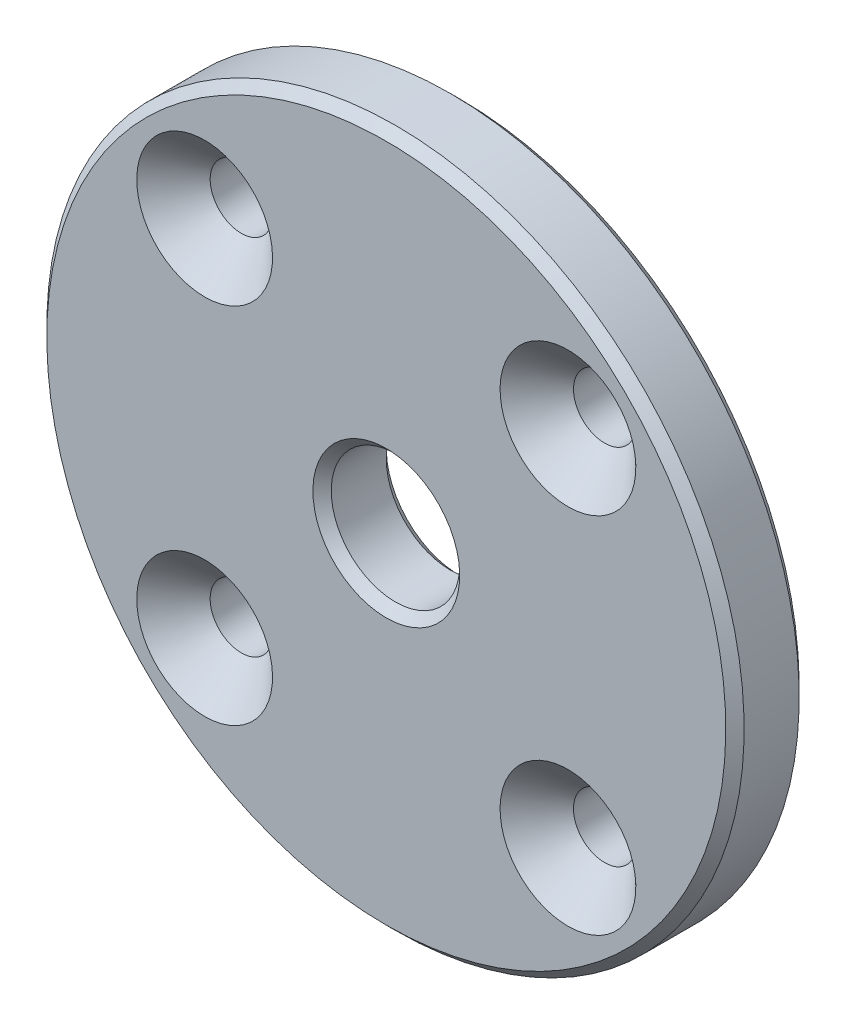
ISO-10303-21;
HEADER;
FILE_DESCRIPTION(('STEP AP214'),'2;1');
FILE_NAME('part.step','',(''),(''),'','','');
FILE_SCHEMA(('AUTOMOTIVE_DESIGN { 1 0 10303 214 1 1 1 1 }'));
ENDSEC;
DATA;
#1=APPLICATION_CONTEXT('core data for automotive mechanical design processes');
#2=APPLICATION_PROTOCOL_DEFINITION('international standard','automotive_design',2000,#1);
#3=PRODUCT_CONTEXT('',#1,'mechanical');
#4=PRODUCT('Part','Part','',(#3));
#5=PRODUCT_RELATED_PRODUCT_CATEGORY('part','',(#4));
#6=PRODUCT_DEFINITION_FORMATION('','',#4);
#7=PRODUCT_DEFINITION_CONTEXT('part definition',#1,'design');
#8=PRODUCT_DEFINITION('design','',#6,#7);
#9=PRODUCT_DEFINITION_SHAPE('','',#8);
#10=(LENGTH_UNIT() NAMED_UNIT(*) SI_UNIT(.MILLI.,.METRE.));
#11=(NAMED_UNIT(*) PLANE_ANGLE_UNIT() SI_UNIT($,.RADIAN.));
#12=(NAMED_UNIT(*) SI_UNIT($,.STERADIAN.) SOLID_ANGLE_UNIT());
#13=UNCERTAINTY_MEASURE_WITH_UNIT(LENGTH_MEASURE(1.E-05),#10,'distance_accuracy_value','');
#14=(GEOMETRIC_REPRESENTATION_CONTEXT(3) GLOBAL_UNCERTAINTY_ASSIGNED_CONTEXT((#13)) GLOBAL_UNIT_ASSIGNED_CONTEXT((#10,
#11,#12)) REPRESENTATION_CONTEXT('',''));
#15=CARTESIAN_POINT('',(0.,0.,0.));
#16=DIRECTION('',(0.,0.,1.));
#17=DIRECTION('',(1.,0.,0.));
#18=AXIS2_PLACEMENT_3D('',#15,#16,#17);
#19=CARTESIAN_POINT('',(3.5,0.,-4.));
#20=DIRECTION('',(0.,0.,-1.));
#21=DIRECTION('',(0.,1.,0.));
#22=AXIS2_PLACEMENT_3D('',#19,#20,#21);
#23=PLANE('',#22);
#24=CARTESIAN_POINT('',(0.,0.,-4.));
#25=DIRECTION('',(0.,0.,-1.));
#26=DIRECTION('',(0.,1.,0.));
#27=AXIS2_PLACEMENT_3D('',#24,#25,#26);
#28=CIRCLE('',#27,4.);
#29=CARTESIAN_POINT('',(0.,3.99999999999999,-4.00000000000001));
#30=VERTEX_POINT('',#29);
#31=EDGE_CURVE('E29',#30,#30,#28,.F.);
#32=ORIENTED_EDGE('',*,*,#31,.T.);
#33=EDGE_LOOP('',(#32));
#34=FACE_BOUND('',#33,.T.);
#35=CARTESIAN_POINT('',(9.89949493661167,-9.89949493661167,-4.));
#36=DIRECTION('',(0.,0.,-1.));
#37=DIRECTION('',(0.,1.,0.));
#38=AXIS2_PLACEMENT_3D('',#35,#36,#37);
#39=CIRCLE('',#38,1.7);
#40=CARTESIAN_POINT('',(9.89949493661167,-8.19949493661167,-4.00000000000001));
#41=VERTEX_POINT('',#40);
#42=EDGE_CURVE('E39',#41,#41,#39,.F.);
#43=ORIENTED_EDGE('',*,*,#42,.T.);
#44=EDGE_LOOP('',(#43));
#45=FACE_BOUND('',#44,.T.);
#46=CARTESIAN_POINT('',(-9.89949493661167,9.89949493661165,-4.));
#47=DIRECTION('',(0.,0.,-1.));
#48=DIRECTION('',(0.,1.,0.));
#49=AXIS2_PLACEMENT_3D('',#46,#47,#48);
#50=CIRCLE('',#49,1.7);
#51=CARTESIAN_POINT('',(-9.89949493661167,11.5994949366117,-4.00000000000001));
#52=VERTEX_POINT('',#51);
#53=EDGE_CURVE('E38',#52,#52,#50,.F.);
#54=ORIENTED_EDGE('',*,*,#53,.T.);
#55=EDGE_LOOP('',(#54));
#56=FACE_BOUND('',#55,.T.);
#57=CARTESIAN_POINT('',(0.,0.,-4.));
#58=DIRECTION('',(0.,0.,-1.));
#59=DIRECTION('',(0.,1.,0.));
#60=AXIS2_PLACEMENT_3D('',#57,#58,#59);
#61=CIRCLE('',#60,18.5);
#62=CARTESIAN_POINT('',(0.,18.5,-4.00000000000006));
#63=VERTEX_POINT('',#62);
#64=EDGE_CURVE('E34',#63,#63,#61,.T.);
#65=ORIENTED_EDGE('',*,*,#64,.T.);
#66=EDGE_LOOP('',(#65));
#67=FACE_BOUND('',#66,.T.);
#68=CARTESIAN_POINT('',(-9.89949493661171,-9.89949493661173,-4.));
#69=DIRECTION('',(0.,0.,-1.));
#70=DIRECTION('',(0.,1.,0.));
#71=AXIS2_PLACEMENT_3D('',#68,#69,#70);
#72=CIRCLE('',#71,1.7);
#73=CARTESIAN_POINT('',(-9.89949493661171,-8.19949493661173,-4.00000000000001));
#74=VERTEX_POINT('',#73);
#75=EDGE_CURVE('E35',#74,#74,#72,.F.);
#76=ORIENTED_EDGE('',*,*,#75,.T.);
#77=EDGE_LOOP('',(#76));
#78=FACE_BOUND('',#77,.T.);
#79=CARTESIAN_POINT('',(9.8994949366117,9.89949493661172,-4.));
#80=DIRECTION('',(0.,0.,-1.));
#81=DIRECTION('',(0.,1.,0.));
#82=AXIS2_PLACEMENT_3D('',#79,#80,#81);
#83=CIRCLE('',#82,1.7);
#84=CARTESIAN_POINT('',(9.8994949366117,11.5994949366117,-4.00000000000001));
#85=VERTEX_POINT('',#84);
#86=EDGE_CURVE('E42',#85,#85,#83,.F.);
#87=ORIENTED_EDGE('',*,*,#86,.T.);
#88=EDGE_LOOP('',(#87));
#89=FACE_BOUND('',#88,.T.);
#90=ADVANCED_FACE('F13',(#34,#45,#56,#67,#78,#89),#23,.T.);
#91=CARTESIAN_POINT('',(3.5,0.,0.));
#92=DIRECTION('',(0.,0.,1.));
#93=DIRECTION('',(0.,-1.,0.));
#94=AXIS2_PLACEMENT_3D('',#91,#92,#93);
#95=PLANE('',#94);
#96=CARTESIAN_POINT('',(0.,0.,0.));
#97=DIRECTION('',(0.,0.,1.));
#98=DIRECTION('',(0.,-1.,0.));
#99=AXIS2_PLACEMENT_3D('',#96,#97,#98);
#100=CIRCLE('',#99,4.);
#101=CARTESIAN_POINT('',(0.,-4.,0.));
#102=VERTEX_POINT('',#101);
#103=EDGE_CURVE('E8',#102,#102,#100,.F.);
#104=ORIENTED_EDGE('',*,*,#103,.T.);
#105=EDGE_LOOP('',(#104));
#106=FACE_BOUND('',#105,.T.);
#107=CARTESIAN_POINT('',(0.,0.,0.));
#108=DIRECTION('',(0.,0.,1.));
#109=DIRECTION('',(0.,-1.,0.));
#110=AXIS2_PLACEMENT_3D('',#107,#108,#109);
#111=CIRCLE('',#110,18.5);
#112=CARTESIAN_POINT('',(0.,-18.5,0.));
#113=VERTEX_POINT('',#112);
#114=EDGE_CURVE('E56',#113,#113,#111,.T.);
#115=ORIENTED_EDGE('',*,*,#114,.T.);
#116=EDGE_LOOP('',(#115));
#117=FACE_BOUND('',#116,.T.);
#118=CARTESIAN_POINT('',(-9.89949493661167,9.89949493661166,0.));
#119=DIRECTION('',(0.,0.,1.));
#120=DIRECTION('',(0.,-1.,0.));
#121=AXIS2_PLACEMENT_3D('',#118,#119,#120);
#122=CIRCLE('',#121,3.7);
#123=CARTESIAN_POINT('',(-9.89949493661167,6.19949493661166,0.));
#124=VERTEX_POINT('',#123);
#125=EDGE_CURVE('E62',#124,#124,#122,.T.);
#126=ORIENTED_EDGE('',*,*,#125,.F.);
#127=EDGE_LOOP('',(#126));
#128=FACE_BOUND('',#127,.T.);
#129=CARTESIAN_POINT('',(-9.89949493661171,-9.89949493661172,0.));
#130=DIRECTION('',(0.,0.,1.));
#131=DIRECTION('',(0.,-1.,0.));
#132=AXIS2_PLACEMENT_3D('',#129,#130,#131);
#133=CIRCLE('',#132,3.7);
#134=CARTESIAN_POINT('',(-9.89949493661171,-13.5994949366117,0.));
#135=VERTEX_POINT('',#134);
#136=EDGE_CURVE('E68',#135,#135,#133,.T.);
#137=ORIENTED_EDGE('',*,*,#136,.F.);
#138=EDGE_LOOP('',(#137));
#139=FACE_BOUND('',#138,.T.);
#140=CARTESIAN_POINT('',(9.89949493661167,-9.89949493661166,0.));
#141=DIRECTION('',(0.,0.,1.));
#142=DIRECTION('',(0.,-1.,0.));
#143=AXIS2_PLACEMENT_3D('',#140,#141,#142);
#144=CIRCLE('',#143,3.7);
#145=CARTESIAN_POINT('',(9.89949493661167,-13.5994949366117,0.));
#146=VERTEX_POINT('',#145);
#147=EDGE_CURVE('E74',#146,#146,#144,.T.);
#148=ORIENTED_EDGE('',*,*,#147,.F.);
#149=EDGE_LOOP('',(#148));
#150=FACE_BOUND('',#149,.T.);
#151=CARTESIAN_POINT('',(9.8994949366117,9.89949493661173,0.));
#152=DIRECTION('',(0.,0.,1.));
#153=DIRECTION('',(0.,-1.,0.));
#154=AXIS2_PLACEMENT_3D('',#151,#152,#153);
#155=CIRCLE('',#154,3.7);
#156=CARTESIAN_POINT('',(9.8994949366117,6.19949493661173,0.));
#157=VERTEX_POINT('',#156);
#158=EDGE_CURVE('E47',#157,#157,#155,.T.);
#159=ORIENTED_EDGE('',*,*,#158,.F.);
#160=EDGE_LOOP('',(#159));
#161=FACE_BOUND('',#160,.T.);
#162=ADVANCED_FACE('F85',(#106,#117,#128,#139,#150,#161),#95,.T.);
#163=CARTESIAN_POINT('',(0.,0.,0.));
#164=DIRECTION('',(0.,0.,1.));
#165=DIRECTION('',(0.,-1.,0.));
#166=AXIS2_PLACEMENT_3D('',#163,#164,#165);
#167=CYLINDRICAL_SURFACE('',#166,19.);
#168=CARTESIAN_POINT('',(0.,0.,-0.500000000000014));
#169=DIRECTION('',(0.,0.,1.));
#170=DIRECTION('',(0.,-1.,0.));
#171=AXIS2_PLACEMENT_3D('',#168,#169,#170);
#172=CIRCLE('',#171,19.);
#173=CARTESIAN_POINT('',(0.,-19.,-0.499999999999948));
#174=VERTEX_POINT('',#173);
#175=EDGE_CURVE('E50',#174,#174,#172,.F.);
#176=ORIENTED_EDGE('',*,*,#175,.T.);
#177=EDGE_LOOP('',(#176));
#178=FACE_BOUND('',#177,.T.);
#179=CARTESIAN_POINT('',(0.,0.,-3.5));
#180=DIRECTION('',(0.,0.,-1.));
#181=DIRECTION('',(0.,1.,0.));
#182=AXIS2_PLACEMENT_3D('',#179,#180,#181);
#183=CIRCLE('',#182,19.);
#184=CARTESIAN_POINT('',(0.,19.,-3.50000000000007));
#185=VERTEX_POINT('',#184);
#186=EDGE_CURVE('E53',#185,#185,#183,.F.);
#187=ORIENTED_EDGE('',*,*,#186,.T.);
#188=EDGE_LOOP('',(#187));
#189=FACE_BOUND('',#188,.T.);
#190=ADVANCED_FACE('F87',(#178,#189),#167,.T.);
#191=CARTESIAN_POINT('',(0.,0.,0.));
#192=DIRECTION('',(0.,0.,-1.));
#193=DIRECTION('',(0.,1.,0.));
#194=AXIS2_PLACEMENT_3D('',#191,#192,#193);
#195=CONICAL_SURFACE('',#194,18.5,0.785398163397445);
#196=ORIENTED_EDGE('',*,*,#175,.F.);
#197=EDGE_LOOP('',(#196));
#198=FACE_BOUND('',#197,.T.);
#199=ORIENTED_EDGE('',*,*,#114,.F.);
#200=EDGE_LOOP('',(#199));
#201=FACE_BOUND('',#200,.T.);
#202=ADVANCED_FACE('F94',(#198,#201),#195,.T.);
#203=CARTESIAN_POINT('',(0.,0.,-3.5));
#204=DIRECTION('',(0.,0.,1.));
#205=DIRECTION('',(0.,-1.,0.));
#206=AXIS2_PLACEMENT_3D('',#203,#204,#205);
#207=CONICAL_SURFACE('',#206,19.,0.785398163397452);
#208=ORIENTED_EDGE('',*,*,#64,.F.);
#209=EDGE_LOOP('',(#208));
#210=FACE_BOUND('',#209,.T.);
#211=ORIENTED_EDGE('',*,*,#186,.F.);
#212=EDGE_LOOP('',(#211));
#213=FACE_BOUND('',#212,.T.);
#214=ADVANCED_FACE('F106',(#210,#213),#207,.T.);
#215=CARTESIAN_POINT('',(-9.89949493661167,9.89949493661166,0.));
#216=DIRECTION('',(0.,0.,1.));
#217=DIRECTION('',(0.,-1.,0.));
#218=AXIS2_PLACEMENT_3D('',#215,#216,#217);
#219=CYLINDRICAL_SURFACE('',#218,1.7);
#220=CARTESIAN_POINT('',(-9.89949493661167,9.89949493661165,-2.00000000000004));
#221=DIRECTION('',(0.,0.,1.));
#222=DIRECTION('',(0.,-1.,0.));
#223=AXIS2_PLACEMENT_3D('',#220,#221,#222);
#224=CIRCLE('',#223,1.7);
#225=CARTESIAN_POINT('',(-9.89949493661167,8.19949493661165,-2.00000000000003));
#226=VERTEX_POINT('',#225);
#227=EDGE_CURVE('E59',#226,#226,#224,.T.);
#228=ORIENTED_EDGE('',*,*,#227,.T.);
#229=EDGE_LOOP('',(#228));
#230=FACE_BOUND('',#229,.T.);
#231=ORIENTED_EDGE('',*,*,#53,.F.);
#232=EDGE_LOOP('',(#231));
#233=FACE_BOUND('',#232,.T.);
#234=ADVANCED_FACE('F110',(#230,#233),#219,.F.);
#235=CARTESIAN_POINT('',(-9.89949493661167,9.89949493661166,0.));
#236=DIRECTION('',(0.,0.,1.));
#237=DIRECTION('',(0.,-1.,0.));
#238=AXIS2_PLACEMENT_3D('',#235,#236,#237);
#239=CONICAL_SURFACE('',#238,3.7,0.785398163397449);
#240=ORIENTED_EDGE('',*,*,#227,.F.);
#241=EDGE_LOOP('',(#240));
#242=FACE_BOUND('',#241,.T.);
#243=ORIENTED_EDGE('',*,*,#125,.T.);
#244=EDGE_LOOP('',(#243));
#245=FACE_BOUND('',#244,.T.);
#246=ADVANCED_FACE('F101',(#242,#245),#239,.F.);
#247=CARTESIAN_POINT('',(-9.89949493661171,-9.89949493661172,0.));
#248=DIRECTION('',(0.,0.,1.));
#249=DIRECTION('',(0.,-1.,0.));
#250=AXIS2_PLACEMENT_3D('',#247,#248,#249);
#251=CYLINDRICAL_SURFACE('',#250,1.7);
#252=CARTESIAN_POINT('',(-9.89949493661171,-9.89949493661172,-1.99999999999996));
#253=DIRECTION('',(0.,0.,1.));
#254=DIRECTION('',(0.,-1.,0.));
#255=AXIS2_PLACEMENT_3D('',#252,#253,#254);
#256=CIRCLE('',#255,1.7);
#257=CARTESIAN_POINT('',(-9.89949493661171,-11.5994949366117,-1.99999999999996));
#258=VERTEX_POINT('',#257);
#259=EDGE_CURVE('E65',#258,#258,#256,.T.);
#260=ORIENTED_EDGE('',*,*,#259,.T.);
#261=EDGE_LOOP('',(#260));
#262=FACE_BOUND('',#261,.T.);
#263=ORIENTED_EDGE('',*,*,#75,.F.);
#264=EDGE_LOOP('',(#263));
#265=FACE_BOUND('',#264,.T.);
#266=ADVANCED_FACE('F119',(#262,#265),#251,.F.);
#267=CARTESIAN_POINT('',(-9.89949493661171,-9.89949493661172,0.));
#268=DIRECTION('',(0.,0.,1.));
#269=DIRECTION('',(0.,-1.,0.));
#270=AXIS2_PLACEMENT_3D('',#267,#268,#269);
#271=CONICAL_SURFACE('',#270,3.7,0.785398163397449);
#272=ORIENTED_EDGE('',*,*,#259,.F.);
#273=EDGE_LOOP('',(#272));
#274=FACE_BOUND('',#273,.T.);
#275=ORIENTED_EDGE('',*,*,#136,.T.);
#276=EDGE_LOOP('',(#275));
#277=FACE_BOUND('',#276,.T.);
#278=ADVANCED_FACE('F122',(#274,#277),#271,.F.);
#279=CARTESIAN_POINT('',(9.89949493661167,-9.89949493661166,0.));
#280=DIRECTION('',(0.,0.,1.));
#281=DIRECTION('',(0.,-1.,0.));
#282=AXIS2_PLACEMENT_3D('',#279,#280,#281);
#283=CYLINDRICAL_SURFACE('',#282,1.7);
#284=CARTESIAN_POINT('',(9.89949493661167,-9.89949493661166,-1.99999999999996));
#285=DIRECTION('',(0.,0.,1.));
#286=DIRECTION('',(0.,-1.,0.));
#287=AXIS2_PLACEMENT_3D('',#284,#285,#286);
#288=CIRCLE('',#287,1.7);
#289=CARTESIAN_POINT('',(9.89949493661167,-11.5994949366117,-1.99999999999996));
#290=VERTEX_POINT('',#289);
#291=EDGE_CURVE('E71',#290,#290,#288,.T.);
#292=ORIENTED_EDGE('',*,*,#291,.T.);
#293=EDGE_LOOP('',(#292));
#294=FACE_BOUND('',#293,.T.);
#295=ORIENTED_EDGE('',*,*,#42,.F.);
#296=EDGE_LOOP('',(#295));
#297=FACE_BOUND('',#296,.T.);
#298=ADVANCED_FACE('F124',(#294,#297),#283,.F.);
#299=CARTESIAN_POINT('',(9.89949493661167,-9.89949493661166,0.));
#300=DIRECTION('',(0.,0.,1.));
#301=DIRECTION('',(0.,-1.,0.));
#302=AXIS2_PLACEMENT_3D('',#299,#300,#301);
#303=CONICAL_SURFACE('',#302,3.7,0.785398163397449);
#304=ORIENTED_EDGE('',*,*,#291,.F.);
#305=EDGE_LOOP('',(#304));
#306=FACE_BOUND('',#305,.T.);
#307=ORIENTED_EDGE('',*,*,#147,.T.);
#308=EDGE_LOOP('',(#307));
#309=FACE_BOUND('',#308,.T.);
#310=ADVANCED_FACE('F127',(#306,#309),#303,.F.);
#311=CARTESIAN_POINT('',(9.8994949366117,9.89949493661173,0.));
#312=DIRECTION('',(0.,0.,1.));
#313=DIRECTION('',(0.,-1.,0.));
#314=AXIS2_PLACEMENT_3D('',#311,#312,#313);
#315=CYLINDRICAL_SURFACE('',#314,1.7);
#316=CARTESIAN_POINT('',(9.8994949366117,9.89949493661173,-2.00000000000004));
#317=DIRECTION('',(0.,0.,1.));
#318=DIRECTION('',(0.,-1.,0.));
#319=AXIS2_PLACEMENT_3D('',#316,#317,#318);
#320=CIRCLE('',#319,1.7);
#321=CARTESIAN_POINT('',(9.8994949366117,8.19949493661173,-2.00000000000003));
#322=VERTEX_POINT('',#321);
#323=EDGE_CURVE('E77',#322,#322,#320,.T.);
#324=ORIENTED_EDGE('',*,*,#323,.T.);
#325=EDGE_LOOP('',(#324));
#326=FACE_BOUND('',#325,.T.);
#327=ORIENTED_EDGE('',*,*,#86,.F.);
#328=EDGE_LOOP('',(#327));
#329=FACE_BOUND('',#328,.T.);
#330=ADVANCED_FACE('F129',(#326,#329),#315,.F.);
#331=CARTESIAN_POINT('',(9.8994949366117,9.89949493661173,0.));
#332=DIRECTION('',(0.,0.,1.));
#333=DIRECTION('',(0.,-1.,0.));
#334=AXIS2_PLACEMENT_3D('',#331,#332,#333);
#335=CONICAL_SURFACE('',#334,3.7,0.785398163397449);
#336=ORIENTED_EDGE('',*,*,#323,.F.);
#337=EDGE_LOOP('',(#336));
#338=FACE_BOUND('',#337,.T.);
#339=ORIENTED_EDGE('',*,*,#158,.T.);
#340=EDGE_LOOP('',(#339));
#341=FACE_BOUND('',#340,.T.);
#342=ADVANCED_FACE('F83',(#338,#341),#335,.F.);
#343=CARTESIAN_POINT('',(0.,0.,0.));
#344=DIRECTION('',(0.,0.,1.));
#345=DIRECTION('',(0.,-1.,0.));
#346=AXIS2_PLACEMENT_3D('',#343,#344,#345);
#347=CYLINDRICAL_SURFACE('',#346,3.5);
#348=CARTESIAN_POINT('',(0.,0.,-3.5));
#349=DIRECTION('',(0.,0.,-1.));
#350=DIRECTION('',(0.,1.,0.));
#351=AXIS2_PLACEMENT_3D('',#348,#349,#350);
#352=CIRCLE('',#351,3.5);
#353=CARTESIAN_POINT('',(0.,3.49999999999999,-3.50000000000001));
#354=VERTEX_POINT('',#353);
#355=EDGE_CURVE('E21',#354,#354,#352,.T.);
#356=ORIENTED_EDGE('',*,*,#355,.T.);
#357=EDGE_LOOP('',(#356));
#358=FACE_BOUND('',#357,.T.);
#359=CARTESIAN_POINT('',(0.,0.,-0.5));
#360=DIRECTION('',(0.,0.,1.));
#361=DIRECTION('',(0.,-1.,0.));
#362=AXIS2_PLACEMENT_3D('',#359,#360,#361);
#363=CIRCLE('',#362,3.5);
#364=CARTESIAN_POINT('',(0.,-3.5,-0.499999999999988));
#365=VERTEX_POINT('',#364);
#366=EDGE_CURVE('E25',#365,#365,#363,.T.);
#367=ORIENTED_EDGE('',*,*,#366,.T.);
#368=EDGE_LOOP('',(#367));
#369=FACE_BOUND('',#368,.T.);
#370=ADVANCED_FACE('F112',(#358,#369),#347,.F.);
#371=CARTESIAN_POINT('',(0.,0.,-4.));
#372=DIRECTION('',(0.,0.,-1.));
#373=DIRECTION('',(0.,1.,0.));
#374=AXIS2_PLACEMENT_3D('',#371,#372,#373);
#375=CONICAL_SURFACE('',#374,4.,0.785398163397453);
#376=ORIENTED_EDGE('',*,*,#355,.F.);
#377=EDGE_LOOP('',(#376));
#378=FACE_BOUND('',#377,.T.);
#379=ORIENTED_EDGE('',*,*,#31,.F.);
#380=EDGE_LOOP('',(#379));
#381=FACE_BOUND('',#380,.T.);
#382=ADVANCED_FACE('F115',(#378,#381),#375,.F.);
#383=CARTESIAN_POINT('',(0.,0.,0.));
#384=DIRECTION('',(0.,0.,1.));
#385=DIRECTION('',(0.,-1.,0.));
#386=AXIS2_PLACEMENT_3D('',#383,#384,#385);
#387=CONICAL_SURFACE('',#386,4.,0.785398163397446);
#388=ORIENTED_EDGE('',*,*,#366,.F.);
#389=EDGE_LOOP('',(#388));
#390=FACE_BOUND('',#389,.T.);
#391=ORIENTED_EDGE('',*,*,#103,.F.);
#392=EDGE_LOOP('',(#391));
#393=FACE_BOUND('',#392,.T.);
#394=ADVANCED_FACE('F16',(#390,#393),#387,.F.);
#395=CLOSED_SHELL('',(#90,#162,#190,#202,#214,#234,#246,#266,#278,#298,#310,#330,#342,#370,#382,#394));
#396=MANIFOLD_SOLID_BREP('B1',#395);
#397=ADVANCED_BREP_SHAPE_REPRESENTATION('',(#18,#396),#14);
#398=SHAPE_DEFINITION_REPRESENTATION(#9,#397);
ENDSEC;
END-ISO-10303-21;
